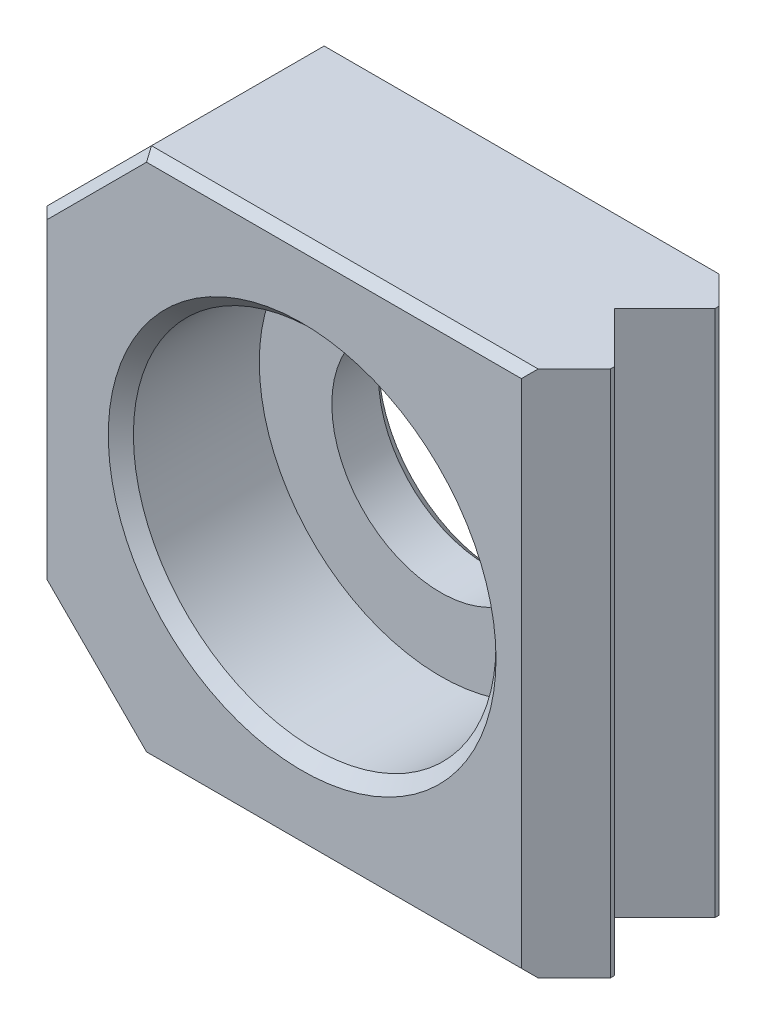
ISO-10303-21;
HEADER;
FILE_DESCRIPTION(('STEP AP214'),'2;1');
FILE_NAME('part.step','',(''),(''),'','','');
FILE_SCHEMA(('AUTOMOTIVE_DESIGN { 1 0 10303 214 1 1 1 1 }'));
ENDSEC;
DATA;
#1=APPLICATION_CONTEXT('core data for automotive mechanical design processes');
#2=APPLICATION_PROTOCOL_DEFINITION('international standard','automotive_design',2000,#1);
#3=PRODUCT_CONTEXT('',#1,'mechanical');
#4=PRODUCT('Part','Part','',(#3));
#5=PRODUCT_RELATED_PRODUCT_CATEGORY('part','',(#4));
#6=PRODUCT_DEFINITION_FORMATION('','',#4);
#7=PRODUCT_DEFINITION_CONTEXT('part definition',#1,'design');
#8=PRODUCT_DEFINITION('design','',#6,#7);
#9=PRODUCT_DEFINITION_SHAPE('','',#8);
#10=(LENGTH_UNIT() NAMED_UNIT(*) SI_UNIT(.MILLI.,.METRE.));
#11=(NAMED_UNIT(*) PLANE_ANGLE_UNIT() SI_UNIT($,.RADIAN.));
#12=(NAMED_UNIT(*) SI_UNIT($,.STERADIAN.) SOLID_ANGLE_UNIT());
#13=UNCERTAINTY_MEASURE_WITH_UNIT(LENGTH_MEASURE(1.E-05),#10,'distance_accuracy_value','');
#14=(GEOMETRIC_REPRESENTATION_CONTEXT(3) GLOBAL_UNCERTAINTY_ASSIGNED_CONTEXT((#13)) GLOBAL_UNIT_ASSIGNED_CONTEXT((#10,
#11,#12)) REPRESENTATION_CONTEXT('',''));
#15=CARTESIAN_POINT('',(0.,0.,0.));
#16=DIRECTION('',(0.,0.,1.));
#17=DIRECTION('',(1.,0.,0.));
#18=AXIS2_PLACEMENT_3D('',#15,#16,#17);
#19=CARTESIAN_POINT('',(8.,-8.,6.));
#20=DIRECTION('',(-1.,0.,0.));
#21=DIRECTION('',(0.,-1.,0.));
#22=AXIS2_PLACEMENT_3D('',#19,#20,#21);
#23=PLANE('',#22);
#24=DIRECTION('',(0.,-1.,0.));
#25=VECTOR('',#24,1.);
#26=CARTESIAN_POINT('',(8.,-8.,4.52399999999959));
#27=LINE('',#26,#25);
#28=CARTESIAN_POINT('',(8.,8.,4.52399999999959));
#29=VERTEX_POINT('',#28);
#30=CARTESIAN_POINT('',(8.,-8.,4.52399999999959));
#31=VERTEX_POINT('',#30);
#32=EDGE_CURVE('E147',#29,#31,#27,.T.);
#33=ORIENTED_EDGE('',*,*,#32,.F.);
#34=DIRECTION('',(0.,0.,-1.));
#35=VECTOR('',#34,1.);
#36=CARTESIAN_POINT('',(8.,8.,6.));
#37=LINE('',#36,#35);
#38=CARTESIAN_POINT('',(8.,8.,4.65099999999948));
#39=VERTEX_POINT('',#38);
#40=EDGE_CURVE('E189',#39,#29,#37,.T.);
#41=ORIENTED_EDGE('',*,*,#40,.F.);
#42=DIRECTION('',(0.,1.,0.));
#43=VECTOR('',#42,1.);
#44=CARTESIAN_POINT('',(8.,-8.,4.65099999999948));
#45=LINE('',#44,#43);
#46=CARTESIAN_POINT('',(8.,-8.,4.65099999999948));
#47=VERTEX_POINT('',#46);
#48=EDGE_CURVE('E173',#47,#39,#45,.T.);
#49=ORIENTED_EDGE('',*,*,#48,.F.);
#50=DIRECTION('',(0.,0.,-1.));
#51=VECTOR('',#50,1.);
#52=CARTESIAN_POINT('',(8.,-8.,6.));
#53=LINE('',#52,#51);
#54=EDGE_CURVE('E185',#47,#31,#53,.T.);
#55=ORIENTED_EDGE('',*,*,#54,.T.);
#56=EDGE_LOOP('',(#33,#41,#49,#55));
#57=FACE_BOUND('',#56,.T.);
#58=ADVANCED_FACE('F14',(#57),#23,.F.);
#59=CARTESIAN_POINT('',(8.,-8.,1.47600000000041));
#60=VERTEX_POINT('',#59);
#61=CARTESIAN_POINT('',(8.,-8.,1.34900000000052));
#62=VERTEX_POINT('',#61);
#63=EDGE_CURVE('E158',#60,#62,#53,.T.);
#64=ORIENTED_EDGE('',*,*,#63,.T.);
#65=DIRECTION('',(0.,1.,0.));
#66=VECTOR('',#65,1.);
#67=CARTESIAN_POINT('',(8.,-8.,1.34900000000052));
#68=LINE('',#67,#66);
#69=CARTESIAN_POINT('',(8.,8.,1.34900000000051));
#70=VERTEX_POINT('',#69);
#71=EDGE_CURVE('E141',#62,#70,#68,.T.);
#72=ORIENTED_EDGE('',*,*,#71,.T.);
#73=CARTESIAN_POINT('',(8.,8.,1.47600000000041));
#74=VERTEX_POINT('',#73);
#75=EDGE_CURVE('E186',#74,#70,#37,.T.);
#76=ORIENTED_EDGE('',*,*,#75,.F.);
#77=DIRECTION('',(0.,-1.,0.));
#78=VECTOR('',#77,1.);
#79=CARTESIAN_POINT('',(8.,-8.,1.47600000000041));
#80=LINE('',#79,#78);
#81=EDGE_CURVE('E176',#74,#60,#80,.T.);
#82=ORIENTED_EDGE('',*,*,#81,.T.);
#83=EDGE_LOOP('',(#64,#72,#76,#82));
#84=FACE_BOUND('',#83,.T.);
#85=ADVANCED_FACE('F336',(#84),#23,.F.);
#86=CARTESIAN_POINT('',(-8.,8.,6.));
#87=DIRECTION('',(0.,1.,0.));
#88=DIRECTION('',(-1.,0.,0.));
#89=AXIS2_PLACEMENT_3D('',#86,#87,#88);
#90=PLANE('',#89);
#91=DIRECTION('',(0.,0.,1.));
#92=VECTOR('',#91,1.);
#93=CARTESIAN_POINT('',(-4.825,8.,6.));
#94=LINE('',#93,#92);
#95=CARTESIAN_POINT('',(-4.825,8.,0.508));
#96=VERTEX_POINT('',#95);
#97=CARTESIAN_POINT('',(-4.825,8.,5.746));
#98=VERTEX_POINT('',#97);
#99=EDGE_CURVE('E196',#96,#98,#94,.T.);
#100=ORIENTED_EDGE('',*,*,#99,.T.);
#101=DIRECTION('',(1.,0.,0.));
#102=VECTOR('',#101,1.);
#103=CARTESIAN_POINT('',(6.651,8.,5.746));
#104=LINE('',#103,#102);
#105=CARTESIAN_POINT('',(6.90499999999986,8.,5.746));
#106=VERTEX_POINT('',#105);
#107=EDGE_CURVE('E9',#98,#106,#104,.T.);
#108=ORIENTED_EDGE('',*,*,#107,.T.);
#109=DIRECTION('',(-0.707106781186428,0.,0.707106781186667));
#110=VECTOR('',#109,1.);
#111=CARTESIAN_POINT('',(8.0635,8.,4.58749999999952));
#112=LINE('',#111,#110);
#113=EDGE_CURVE('E162',#39,#106,#112,.T.);
#114=ORIENTED_EDGE('',*,*,#113,.F.);
#115=ORIENTED_EDGE('',*,*,#40,.T.);
#116=DIRECTION('',(0.707106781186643,0.,0.707106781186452));
#117=VECTOR('',#116,1.);
#118=CARTESIAN_POINT('',(6.476,8.,3.));
#119=LINE('',#118,#117);
#120=CARTESIAN_POINT('',(6.476,8.,3.));
#121=VERTEX_POINT('',#120);
#122=EDGE_CURVE('E168',#121,#29,#119,.T.);
#123=ORIENTED_EDGE('',*,*,#122,.F.);
#124=DIRECTION('',(0.707106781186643,0.,-0.707106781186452));
#125=VECTOR('',#124,1.);
#126=CARTESIAN_POINT('',(6.476,8.,3.));
#127=LINE('',#126,#125);
#128=EDGE_CURVE('E138',#121,#74,#127,.T.);
#129=ORIENTED_EDGE('',*,*,#128,.T.);
#130=ORIENTED_EDGE('',*,*,#75,.T.);
#131=DIRECTION('',(-0.707106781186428,0.,-0.707106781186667));
#132=VECTOR('',#131,1.);
#133=CARTESIAN_POINT('',(8.0635,8.,1.41250000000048));
#134=LINE('',#133,#132);
#135=CARTESIAN_POINT('',(7.15899999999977,8.,0.508));
#136=VERTEX_POINT('',#135);
#137=EDGE_CURVE('E159',#70,#136,#134,.T.);
#138=ORIENTED_EDGE('',*,*,#137,.T.);
#139=DIRECTION('',(-1.,0.,0.));
#140=VECTOR('',#139,1.);
#141=CARTESIAN_POINT('',(-8.,8.,0.508));
#142=LINE('',#141,#140);
#143=EDGE_CURVE('E241',#136,#96,#142,.T.);
#144=ORIENTED_EDGE('',*,*,#143,.T.);
#145=EDGE_LOOP('',(#100,#108,#114,#115,#123,#129,#130,#138,#144));
#146=FACE_BOUND('',#145,.T.);
#147=ADVANCED_FACE('F341',(#146),#90,.T.);
#148=CARTESIAN_POINT('',(8.,-8.,6.));
#149=DIRECTION('',(0.,-1.,0.));
#150=DIRECTION('',(1.,0.,0.));
#151=AXIS2_PLACEMENT_3D('',#148,#149,#150);
#152=PLANE('',#151);
#153=DIRECTION('',(-0.707106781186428,0.,0.707106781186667));
#154=VECTOR('',#153,1.);
#155=CARTESIAN_POINT('',(8.0635,-8.,4.58749999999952));
#156=LINE('',#155,#154);
#157=CARTESIAN_POINT('',(6.90499999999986,-8.,5.746));
#158=VERTEX_POINT('',#157);
#159=EDGE_CURVE('E151',#47,#158,#156,.T.);
#160=ORIENTED_EDGE('',*,*,#159,.T.);
#161=DIRECTION('',(-1.,0.,0.));
#162=VECTOR('',#161,1.);
#163=CARTESIAN_POINT('',(-4.825,-8.,5.746));
#164=LINE('',#163,#162);
#165=CARTESIAN_POINT('',(-4.825,-8.,5.746));
#166=VERTEX_POINT('',#165);
#167=EDGE_CURVE('E243',#158,#166,#164,.T.);
#168=ORIENTED_EDGE('',*,*,#167,.T.);
#169=DIRECTION('',(0.,0.,-1.));
#170=VECTOR('',#169,1.);
#171=CARTESIAN_POINT('',(-4.825,-8.,0.));
#172=LINE('',#171,#170);
#173=CARTESIAN_POINT('',(-4.825,-8.,0.508));
#174=VERTEX_POINT('',#173);
#175=EDGE_CURVE('E190',#166,#174,#172,.T.);
#176=ORIENTED_EDGE('',*,*,#175,.T.);
#177=DIRECTION('',(1.,0.,0.));
#178=VECTOR('',#177,1.);
#179=CARTESIAN_POINT('',(8.,-8.,0.508));
#180=LINE('',#179,#178);
#181=CARTESIAN_POINT('',(7.15899999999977,-8.,0.508));
#182=VERTEX_POINT('',#181);
#183=EDGE_CURVE('E227',#174,#182,#180,.T.);
#184=ORIENTED_EDGE('',*,*,#183,.T.);
#185=DIRECTION('',(-0.707106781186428,0.,-0.707106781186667));
#186=VECTOR('',#185,1.);
#187=CARTESIAN_POINT('',(8.0635,-8.,1.41250000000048));
#188=LINE('',#187,#186);
#189=EDGE_CURVE('E302',#62,#182,#188,.T.);
#190=ORIENTED_EDGE('',*,*,#189,.F.);
#191=ORIENTED_EDGE('',*,*,#63,.F.);
#192=DIRECTION('',(0.707106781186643,0.,-0.707106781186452));
#193=VECTOR('',#192,1.);
#194=CARTESIAN_POINT('',(6.476,-8.,3.));
#195=LINE('',#194,#193);
#196=CARTESIAN_POINT('',(6.476,-8.,3.));
#197=VERTEX_POINT('',#196);
#198=EDGE_CURVE('E135',#197,#60,#195,.T.);
#199=ORIENTED_EDGE('',*,*,#198,.F.);
#200=DIRECTION('',(0.707106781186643,0.,0.707106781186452));
#201=VECTOR('',#200,1.);
#202=CARTESIAN_POINT('',(6.476,-8.,3.));
#203=LINE('',#202,#201);
#204=EDGE_CURVE('E144',#197,#31,#203,.T.);
#205=ORIENTED_EDGE('',*,*,#204,.T.);
#206=ORIENTED_EDGE('',*,*,#54,.F.);
#207=EDGE_LOOP('',(#160,#168,#176,#184,#190,#191,#199,#205,#206));
#208=FACE_BOUND('',#207,.T.);
#209=ADVANCED_FACE('F155',(#208),#152,.T.);
#210=CARTESIAN_POINT('',(8.,8.,6.));
#211=DIRECTION('',(0.,0.,-1.));
#212=DIRECTION('',(1.,0.,0.));
#213=AXIS2_PLACEMENT_3D('',#210,#211,#212);
#214=PLANE('',#213);
#215=CARTESIAN_POINT('',(0.,0.,6.));
#216=DIRECTION('',(0.,0.,-1.));
#217=DIRECTION('',(1.,0.,0.));
#218=AXIS2_PLACEMENT_3D('',#215,#216,#217);
#219=CIRCLE('',#218,5.881);
#220=CARTESIAN_POINT('',(5.881,0.,6.));
#221=VERTEX_POINT('',#220);
#222=EDGE_CURVE('E207',#221,#221,#219,.T.);
#223=ORIENTED_EDGE('',*,*,#222,.T.);
#224=EDGE_LOOP('',(#223));
#225=FACE_BOUND('',#224,.T.);
#226=DIRECTION('',(0.707106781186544,-0.707106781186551,0.));
#227=VECTOR('',#226,1.);
#228=CARTESIAN_POINT('',(-4.64539487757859,-7.82039487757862,6.));
#229=LINE('',#228,#227);
#230=CARTESIAN_POINT('',(-7.746,-4.71978975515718,6.));
#231=VERTEX_POINT('',#230);
#232=CARTESIAN_POINT('',(-4.71978975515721,-7.746,6.));
#233=VERTEX_POINT('',#232);
#234=EDGE_CURVE('E252',#231,#233,#229,.T.);
#235=ORIENTED_EDGE('',*,*,#234,.T.);
#236=DIRECTION('',(1.,0.,0.));
#237=VECTOR('',#236,1.);
#238=CARTESIAN_POINT('',(6.651,-7.746,6.));
#239=LINE('',#238,#237);
#240=CARTESIAN_POINT('',(6.651,-7.746,6.));
#241=VERTEX_POINT('',#240);
#242=EDGE_CURVE('E254',#233,#241,#239,.T.);
#243=ORIENTED_EDGE('',*,*,#242,.T.);
#244=DIRECTION('',(0.,-1.,0.));
#245=VECTOR('',#244,1.);
#246=CARTESIAN_POINT('',(6.651,8.,6.));
#247=LINE('',#246,#245);
#248=CARTESIAN_POINT('',(6.651,7.746,6.));
#249=VERTEX_POINT('',#248);
#250=EDGE_CURVE('E201',#249,#241,#247,.T.);
#251=ORIENTED_EDGE('',*,*,#250,.F.);
#252=DIRECTION('',(-1.,0.,0.));
#253=VECTOR('',#252,1.);
#254=CARTESIAN_POINT('',(-4.825,7.746,6.));
#255=LINE('',#254,#253);
#256=CARTESIAN_POINT('',(-4.71978975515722,7.746,6.));
#257=VERTEX_POINT('',#256);
#258=EDGE_CURVE('E246',#249,#257,#255,.T.);
#259=ORIENTED_EDGE('',*,*,#258,.T.);
#260=DIRECTION('',(-0.707106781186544,-0.707106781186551,0.));
#261=VECTOR('',#260,1.);
#262=CARTESIAN_POINT('',(-7.82039487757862,4.64539487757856,6.));
#263=LINE('',#262,#261);
#264=CARTESIAN_POINT('',(-7.746,4.71978975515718,6.));
#265=VERTEX_POINT('',#264);
#266=EDGE_CURVE('E248',#257,#265,#263,.T.);
#267=ORIENTED_EDGE('',*,*,#266,.T.);
#268=DIRECTION('',(0.,-1.,0.));
#269=VECTOR('',#268,1.);
#270=CARTESIAN_POINT('',(-7.746,8.,6.));
#271=LINE('',#270,#269);
#272=EDGE_CURVE('E250',#265,#231,#271,.T.);
#273=ORIENTED_EDGE('',*,*,#272,.T.);
#274=EDGE_LOOP('',(#235,#243,#251,#259,#267,#273));
#275=FACE_BOUND('',#274,.T.);
#276=ADVANCED_FACE('F313',(#225,#275),#214,.F.);
#277=CARTESIAN_POINT('',(-8.,8.,6.));
#278=DIRECTION('',(1.,0.,0.));
#279=DIRECTION('',(0.,1.,0.));
#280=AXIS2_PLACEMENT_3D('',#277,#278,#279);
#281=PLANE('',#280);
#282=DIRECTION('',(0.,0.,1.));
#283=VECTOR('',#282,1.);
#284=CARTESIAN_POINT('',(-8.,-4.825,6.));
#285=LINE('',#284,#283);
#286=CARTESIAN_POINT('',(-8.,-4.825,0.508));
#287=VERTEX_POINT('',#286);
#288=CARTESIAN_POINT('',(-8.,-4.825,5.746));
#289=VERTEX_POINT('',#288);
#290=EDGE_CURVE('E194',#287,#289,#285,.T.);
#291=ORIENTED_EDGE('',*,*,#290,.T.);
#292=DIRECTION('',(0.,1.,0.));
#293=VECTOR('',#292,1.);
#294=CARTESIAN_POINT('',(-8.,8.,5.746));
#295=LINE('',#294,#293);
#296=CARTESIAN_POINT('',(-8.,4.82499999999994,5.746));
#297=VERTEX_POINT('',#296);
#298=EDGE_CURVE('E35',#289,#297,#295,.T.);
#299=ORIENTED_EDGE('',*,*,#298,.T.);
#300=DIRECTION('',(0.,0.,-1.));
#301=VECTOR('',#300,1.);
#302=CARTESIAN_POINT('',(-8.,4.82499999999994,0.));
#303=LINE('',#302,#301);
#304=CARTESIAN_POINT('',(-8.,4.82499999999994,0.508));
#305=VERTEX_POINT('',#304);
#306=EDGE_CURVE('E192',#297,#305,#303,.T.);
#307=ORIENTED_EDGE('',*,*,#306,.T.);
#308=DIRECTION('',(0.,-1.,0.));
#309=VECTOR('',#308,1.);
#310=CARTESIAN_POINT('',(-8.,-4.825,0.508));
#311=LINE('',#310,#309);
#312=EDGE_CURVE('E236',#305,#287,#311,.T.);
#313=ORIENTED_EDGE('',*,*,#312,.T.);
#314=EDGE_LOOP('',(#291,#299,#307,#313));
#315=FACE_BOUND('',#314,.T.);
#316=ADVANCED_FACE('F271',(#315),#281,.F.);
#317=CARTESIAN_POINT('',(8.,8.,0.));
#318=DIRECTION('',(0.,0.,-1.));
#319=DIRECTION('',(1.,0.,0.));
#320=AXIS2_PLACEMENT_3D('',#317,#318,#319);
#321=PLANE('',#320);
#322=CARTESIAN_POINT('',(0.,0.,0.));
#323=DIRECTION('',(0.,0.,-1.));
#324=DIRECTION('',(1.,0.,0.));
#325=AXIS2_PLACEMENT_3D('',#322,#323,#324);
#326=CIRCLE('',#325,3.681);
#327=CARTESIAN_POINT('',(3.681,0.,0.));
#328=VERTEX_POINT('',#327);
#329=EDGE_CURVE('E210',#328,#328,#326,.F.);
#330=ORIENTED_EDGE('',*,*,#329,.T.);
#331=EDGE_LOOP('',(#330));
#332=FACE_BOUND('',#331,.T.);
#333=DIRECTION('',(0.,1.,0.));
#334=VECTOR('',#333,1.);
#335=CARTESIAN_POINT('',(6.651,8.,0.));
#336=LINE('',#335,#334);
#337=CARTESIAN_POINT('',(6.651,-7.492,0.));
#338=VERTEX_POINT('',#337);
#339=CARTESIAN_POINT('',(6.651,7.492,0.));
#340=VERTEX_POINT('',#339);
#341=EDGE_CURVE('E198',#338,#340,#336,.T.);
#342=ORIENTED_EDGE('',*,*,#341,.F.);
#343=DIRECTION('',(-1.,0.,0.));
#344=VECTOR('',#343,1.);
#345=CARTESIAN_POINT('',(8.,-7.492,0.));
#346=LINE('',#345,#344);
#347=CARTESIAN_POINT('',(-4.61457951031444,-7.492,0.));
#348=VERTEX_POINT('',#347);
#349=EDGE_CURVE('E224',#338,#348,#346,.T.);
#350=ORIENTED_EDGE('',*,*,#349,.T.);
#351=DIRECTION('',(-0.707106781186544,0.707106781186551,0.));
#352=VECTOR('',#351,1.);
#353=CARTESIAN_POINT('',(-6.05328975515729,-6.05328975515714,0.));
#354=LINE('',#353,#352);
#355=CARTESIAN_POINT('',(-7.492,-4.61457951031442,0.));
#356=VERTEX_POINT('',#355);
#357=EDGE_CURVE('E222',#348,#356,#354,.T.);
#358=ORIENTED_EDGE('',*,*,#357,.T.);
#359=DIRECTION('',(0.,1.,0.));
#360=VECTOR('',#359,1.);
#361=CARTESIAN_POINT('',(-7.492,4.82499999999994,0.));
#362=LINE('',#361,#360);
#363=CARTESIAN_POINT('',(-7.492,4.61457951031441,0.));
#364=VERTEX_POINT('',#363);
#365=EDGE_CURVE('E220',#356,#364,#362,.T.);
#366=ORIENTED_EDGE('',*,*,#365,.T.);
#367=DIRECTION('',(0.707106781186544,0.707106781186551,0.));
#368=VECTOR('',#367,1.);
#369=CARTESIAN_POINT('',(1.94671024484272,14.0532897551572,0.));
#370=LINE('',#369,#368);
#371=CARTESIAN_POINT('',(-4.61457951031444,7.492,0.));
#372=VERTEX_POINT('',#371);
#373=EDGE_CURVE('E218',#364,#372,#370,.T.);
#374=ORIENTED_EDGE('',*,*,#373,.T.);
#375=DIRECTION('',(1.,0.,0.));
#376=VECTOR('',#375,1.);
#377=CARTESIAN_POINT('',(8.,7.492,0.));
#378=LINE('',#377,#376);
#379=EDGE_CURVE('E216',#372,#340,#378,.T.);
#380=ORIENTED_EDGE('',*,*,#379,.T.);
#381=EDGE_LOOP('',(#342,#350,#358,#366,#374,#380));
#382=FACE_BOUND('',#381,.T.);
#383=ADVANCED_FACE('F375',(#332,#382),#321,.T.);
#384=CARTESIAN_POINT('',(-4.825,-8.,6.));
#385=DIRECTION('',(-0.707106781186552,-0.707106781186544,0.));
#386=DIRECTION('',(0.707106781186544,-0.707106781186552,0.));
#387=AXIS2_PLACEMENT_3D('',#384,#385,#386);
#388=PLANE('',#387);
#389=ORIENTED_EDGE('',*,*,#175,.F.);
#390=DIRECTION('',(-0.707106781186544,0.707106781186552,0.));
#391=VECTOR('',#390,1.);
#392=CARTESIAN_POINT('',(-8.,-4.82499999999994,5.746));
#393=LINE('',#392,#391);
#394=EDGE_CURVE('E260',#166,#289,#393,.T.);
#395=ORIENTED_EDGE('',*,*,#394,.T.);
#396=ORIENTED_EDGE('',*,*,#290,.F.);
#397=DIRECTION('',(0.707106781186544,-0.707106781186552,0.));
#398=VECTOR('',#397,1.);
#399=CARTESIAN_POINT('',(-4.825,-8.,0.508));
#400=LINE('',#399,#398);
#401=EDGE_CURVE('E233',#287,#174,#400,.T.);
#402=ORIENTED_EDGE('',*,*,#401,.T.);
#403=EDGE_LOOP('',(#389,#395,#396,#402));
#404=FACE_BOUND('',#403,.T.);
#405=ADVANCED_FACE('F266',(#404),#388,.T.);
#406=CARTESIAN_POINT('',(-8.,4.82499999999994,6.));
#407=DIRECTION('',(-0.707106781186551,0.707106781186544,0.));
#408=DIRECTION('',(-0.707106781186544,-0.707106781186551,0.));
#409=AXIS2_PLACEMENT_3D('',#406,#407,#408);
#410=PLANE('',#409);
#411=ORIENTED_EDGE('',*,*,#306,.F.);
#412=DIRECTION('',(0.707106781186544,0.707106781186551,0.));
#413=VECTOR('',#412,1.);
#414=CARTESIAN_POINT('',(-4.825,8.,5.746));
#415=LINE('',#414,#413);
#416=EDGE_CURVE('E21',#297,#98,#415,.T.);
#417=ORIENTED_EDGE('',*,*,#416,.T.);
#418=ORIENTED_EDGE('',*,*,#99,.F.);
#419=DIRECTION('',(-0.707106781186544,-0.707106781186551,0.));
#420=VECTOR('',#419,1.);
#421=CARTESIAN_POINT('',(-8.,4.82499999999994,0.508));
#422=LINE('',#421,#420);
#423=EDGE_CURVE('E238',#96,#305,#422,.T.);
#424=ORIENTED_EDGE('',*,*,#423,.T.);
#425=EDGE_LOOP('',(#411,#417,#418,#424));
#426=FACE_BOUND('',#425,.T.);
#427=ADVANCED_FACE('F348',(#426),#410,.T.);
#428=CARTESIAN_POINT('',(0.,0.,1.8));
#429=DIRECTION('',(0.,0.,1.));
#430=DIRECTION('',(-1.,0.,0.));
#431=AXIS2_PLACEMENT_3D('',#428,#429,#430);
#432=CYLINDRICAL_SURFACE('',#431,5.5);
#433=CARTESIAN_POINT('',(0.,0.,5.619));
#434=DIRECTION('',(0.,0.,-1.));
#435=DIRECTION('',(1.,0.,0.));
#436=AXIS2_PLACEMENT_3D('',#433,#434,#435);
#437=CIRCLE('',#436,5.5);
#438=CARTESIAN_POINT('',(5.5,0.,5.619));
#439=VERTEX_POINT('',#438);
#440=EDGE_CURVE('E204',#439,#439,#437,.F.);
#441=ORIENTED_EDGE('',*,*,#440,.T.);
#442=EDGE_LOOP('',(#441));
#443=FACE_BOUND('',#442,.T.);
#444=CARTESIAN_POINT('',(0.,0.,1.8));
#445=DIRECTION('',(0.,0.,1.));
#446=DIRECTION('',(-1.,0.,0.));
#447=AXIS2_PLACEMENT_3D('',#444,#445,#446);
#448=CIRCLE('',#447,5.5);
#449=CARTESIAN_POINT('',(-5.5,0.,1.8));
#450=VERTEX_POINT('',#449);
#451=EDGE_CURVE('E181',#450,#450,#448,.T.);
#452=ORIENTED_EDGE('',*,*,#451,.F.);
#453=EDGE_LOOP('',(#452));
#454=FACE_BOUND('',#453,.T.);
#455=ADVANCED_FACE('F437',(#443,#454),#432,.F.);
#456=CARTESIAN_POINT('',(0.,0.,1.8));
#457=DIRECTION('',(0.,0.,1.));
#458=DIRECTION('',(-1.,0.,0.));
#459=AXIS2_PLACEMENT_3D('',#456,#457,#458);
#460=PLANE('',#459);
#461=CARTESIAN_POINT('',(0.,0.,1.8));
#462=DIRECTION('',(0.,0.,1.));
#463=DIRECTION('',(-1.,0.,0.));
#464=AXIS2_PLACEMENT_3D('',#461,#462,#463);
#465=CIRCLE('',#464,3.3);
#466=CARTESIAN_POINT('',(-3.3,0.,1.8));
#467=VERTEX_POINT('',#466);
#468=EDGE_CURVE('E178',#467,#467,#465,.T.);
#469=ORIENTED_EDGE('',*,*,#468,.F.);
#470=EDGE_LOOP('',(#469));
#471=FACE_BOUND('',#470,.T.);
#472=ORIENTED_EDGE('',*,*,#451,.T.);
#473=EDGE_LOOP('',(#472));
#474=FACE_BOUND('',#473,.T.);
#475=ADVANCED_FACE('F445',(#471,#474),#460,.T.);
#476=CARTESIAN_POINT('',(0.,0.,0.));
#477=DIRECTION('',(0.,0.,1.));
#478=DIRECTION('',(-1.,0.,0.));
#479=AXIS2_PLACEMENT_3D('',#476,#477,#478);
#480=CYLINDRICAL_SURFACE('',#479,3.3);
#481=CARTESIAN_POINT('',(0.,0.,0.381));
#482=DIRECTION('',(0.,0.,-1.));
#483=DIRECTION('',(1.,0.,0.));
#484=AXIS2_PLACEMENT_3D('',#481,#482,#483);
#485=CIRCLE('',#484,3.3);
#486=CARTESIAN_POINT('',(3.3,0.,0.381));
#487=VERTEX_POINT('',#486);
#488=EDGE_CURVE('E213',#487,#487,#485,.T.);
#489=ORIENTED_EDGE('',*,*,#488,.T.);
#490=EDGE_LOOP('',(#489));
#491=FACE_BOUND('',#490,.T.);
#492=ORIENTED_EDGE('',*,*,#468,.T.);
#493=EDGE_LOOP('',(#492));
#494=FACE_BOUND('',#493,.T.);
#495=ADVANCED_FACE('F455',(#491,#494),#480,.F.);
#496=CARTESIAN_POINT('',(8.0635,8.,1.41250000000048));
#497=DIRECTION('',(-0.707106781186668,0.,0.707106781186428));
#498=DIRECTION('',(-0.707106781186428,0.,-0.707106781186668));
#499=AXIS2_PLACEMENT_3D('',#496,#497,#498);
#500=PLANE('',#499);
#501=ORIENTED_EDGE('',*,*,#189,.T.);
#502=DIRECTION('',(0.577350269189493,-0.577350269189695,0.577350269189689));
#503=VECTOR('',#502,1.);
#504=CARTESIAN_POINT('',(7.10066666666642,-7.94166666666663,0.449666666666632));
#505=LINE('',#504,#503);
#506=EDGE_CURVE('E231',#182,#338,#505,.F.);
#507=ORIENTED_EDGE('',*,*,#506,.T.);
#508=ORIENTED_EDGE('',*,*,#341,.T.);
#509=DIRECTION('',(-0.577350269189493,-0.577350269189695,-0.577350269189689));
#510=VECTOR('',#509,1.);
#511=CARTESIAN_POINT('',(7.10066666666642,7.94166666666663,0.449666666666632));
#512=LINE('',#511,#510);
#513=EDGE_CURVE('E229',#340,#136,#512,.F.);
#514=ORIENTED_EDGE('',*,*,#513,.T.);
#515=ORIENTED_EDGE('',*,*,#137,.F.);
#516=ORIENTED_EDGE('',*,*,#71,.F.);
#517=EDGE_LOOP('',(#501,#507,#508,#514,#515,#516));
#518=FACE_BOUND('',#517,.T.);
#519=ADVANCED_FACE('F371',(#518),#500,.F.);
#520=CARTESIAN_POINT('',(8.0635,8.,4.58749999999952));
#521=DIRECTION('',(0.707106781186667,0.,0.707106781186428));
#522=DIRECTION('',(-0.707106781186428,0.,0.707106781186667));
#523=AXIS2_PLACEMENT_3D('',#520,#521,#522);
#524=PLANE('',#523);
#525=ORIENTED_EDGE('',*,*,#250,.T.);
#526=DIRECTION('',(0.577350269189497,-0.577350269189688,-0.577350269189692));
#527=VECTOR('',#526,1.);
#528=CARTESIAN_POINT('',(2.34400000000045,-3.43899999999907,10.3070000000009));
#529=LINE('',#528,#527);
#530=EDGE_CURVE('E258',#241,#158,#529,.T.);
#531=ORIENTED_EDGE('',*,*,#530,.T.);
#532=ORIENTED_EDGE('',*,*,#159,.F.);
#533=ORIENTED_EDGE('',*,*,#48,.T.);
#534=ORIENTED_EDGE('',*,*,#113,.T.);
#535=DIRECTION('',(-0.577350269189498,-0.577350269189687,0.577350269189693));
#536=VECTOR('',#535,1.);
#537=CARTESIAN_POINT('',(7.67733333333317,8.77233333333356,4.97366666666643));
#538=LINE('',#537,#536);
#539=EDGE_CURVE('E256',#106,#249,#538,.T.);
#540=ORIENTED_EDGE('',*,*,#539,.T.);
#541=EDGE_LOOP('',(#525,#531,#532,#533,#534,#540));
#542=FACE_BOUND('',#541,.T.);
#543=ADVANCED_FACE('F315',(#542),#524,.T.);
#544=CARTESIAN_POINT('',(6.476,8.,3.));
#545=DIRECTION('',(-0.707106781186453,0.,-0.707106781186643));
#546=DIRECTION('',(0.707106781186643,0.,-0.707106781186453));
#547=AXIS2_PLACEMENT_3D('',#544,#545,#546);
#548=PLANE('',#547);
#549=ORIENTED_EDGE('',*,*,#128,.F.);
#550=DIRECTION('',(0.,-1.,0.));
#551=VECTOR('',#550,1.);
#552=CARTESIAN_POINT('',(6.476,8.,3.));
#553=LINE('',#552,#551);
#554=EDGE_CURVE('E131',#121,#197,#553,.T.);
#555=ORIENTED_EDGE('',*,*,#554,.T.);
#556=ORIENTED_EDGE('',*,*,#198,.T.);
#557=ORIENTED_EDGE('',*,*,#81,.F.);
#558=EDGE_LOOP('',(#549,#555,#556,#557));
#559=FACE_BOUND('',#558,.T.);
#560=ADVANCED_FACE('F133',(#559),#548,.F.);
#561=CARTESIAN_POINT('',(6.476,8.,3.));
#562=DIRECTION('',(0.707106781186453,0.,-0.707106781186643));
#563=DIRECTION('',(0.707106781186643,0.,0.707106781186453));
#564=AXIS2_PLACEMENT_3D('',#561,#562,#563);
#565=PLANE('',#564);
#566=ORIENTED_EDGE('',*,*,#32,.T.);
#567=ORIENTED_EDGE('',*,*,#204,.F.);
#568=ORIENTED_EDGE('',*,*,#554,.F.);
#569=ORIENTED_EDGE('',*,*,#122,.T.);
#570=EDGE_LOOP('',(#566,#567,#568,#569));
#571=FACE_BOUND('',#570,.T.);
#572=ADVANCED_FACE('F145',(#571),#565,.T.);
#573=CARTESIAN_POINT('',(0.,0.,5.619));
#574=DIRECTION('',(0.,0.,1.));
#575=DIRECTION('',(-1.,0.,0.));
#576=AXIS2_PLACEMENT_3D('',#573,#574,#575);
#577=CONICAL_SURFACE('',#576,5.5,0.785398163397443);
#578=ORIENTED_EDGE('',*,*,#222,.F.);
#579=EDGE_LOOP('',(#578));
#580=FACE_BOUND('',#579,.T.);
#581=ORIENTED_EDGE('',*,*,#440,.F.);
#582=EDGE_LOOP('',(#581));
#583=FACE_BOUND('',#582,.T.);
#584=ADVANCED_FACE('F498',(#580,#583),#577,.F.);
#585=CARTESIAN_POINT('',(0.,0.,0.));
#586=DIRECTION('',(0.,0.,-1.));
#587=DIRECTION('',(1.,0.,0.));
#588=AXIS2_PLACEMENT_3D('',#585,#586,#587);
#589=CONICAL_SURFACE('',#588,3.681,0.785398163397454);
#590=ORIENTED_EDGE('',*,*,#488,.F.);
#591=EDGE_LOOP('',(#590));
#592=FACE_BOUND('',#591,.T.);
#593=ORIENTED_EDGE('',*,*,#329,.F.);
#594=EDGE_LOOP('',(#593));
#595=FACE_BOUND('',#594,.T.);
#596=ADVANCED_FACE('F507',(#592,#595),#589,.F.);
#597=CARTESIAN_POINT('',(8.,7.492,0.));
#598=DIRECTION('',(0.,-0.707106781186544,0.707106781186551));
#599=DIRECTION('',(0.,-0.707106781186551,-0.707106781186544));
#600=AXIS2_PLACEMENT_3D('',#597,#598,#599);
#601=PLANE('',#600);
#602=ORIENTED_EDGE('',*,*,#513,.F.);
#603=ORIENTED_EDGE('',*,*,#379,.F.);
#604=DIRECTION('',(-0.281084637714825,0.67859834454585,0.678598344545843));
#605=VECTOR('',#604,1.);
#606=CARTESIAN_POINT('',(-3.61791957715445,5.0858500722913,-2.40614992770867));
#607=LINE('',#606,#605);
#608=EDGE_CURVE('E299',#96,#372,#607,.F.);
#609=ORIENTED_EDGE('',*,*,#608,.F.);
#610=ORIENTED_EDGE('',*,*,#143,.F.);
#611=EDGE_LOOP('',(#602,#603,#609,#610));
#612=FACE_BOUND('',#611,.T.);
#613=ADVANCED_FACE('F354',(#612),#601,.F.);
#614=CARTESIAN_POINT('',(1.94671024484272,14.0532897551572,0.));
#615=DIRECTION('',(0.5,-0.5,0.707106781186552));
#616=DIRECTION('',(-0.816496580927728,0.,0.577350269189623));
#617=AXIS2_PLACEMENT_3D('',#614,#615,#616);
#618=PLANE('',#617);
#619=ORIENTED_EDGE('',*,*,#608,.T.);
#620=ORIENTED_EDGE('',*,*,#373,.F.);
#621=DIRECTION('',(0.67859834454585,-0.281084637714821,-0.678598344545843));
#622=VECTOR('',#621,1.);
#623=CARTESIAN_POINT('',(-4.94588768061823,3.55994525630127,-2.54611231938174));
#624=LINE('',#623,#622);
#625=EDGE_CURVE('E296',#305,#364,#624,.T.);
#626=ORIENTED_EDGE('',*,*,#625,.F.);
#627=ORIENTED_EDGE('',*,*,#423,.F.);
#628=EDGE_LOOP('',(#619,#620,#626,#627));
#629=FACE_BOUND('',#628,.T.);
#630=ADVANCED_FACE('F357',(#629),#618,.F.);
#631=CARTESIAN_POINT('',(-8.,8.,0.508));
#632=DIRECTION('',(-0.707106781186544,0.,-0.707106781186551));
#633=DIRECTION('',(0.707106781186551,0.,-0.707106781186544));
#634=AXIS2_PLACEMENT_3D('',#631,#632,#633);
#635=PLANE('',#634);
#636=ORIENTED_EDGE('',*,*,#625,.T.);
#637=ORIENTED_EDGE('',*,*,#365,.F.);
#638=DIRECTION('',(0.678598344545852,0.281084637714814,-0.678598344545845));
#639=VECTOR('',#638,1.);
#640=CARTESIAN_POINT('',(-5.55371371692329,-3.81171504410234,-1.93828628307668));
#641=LINE('',#640,#639);
#642=EDGE_CURVE('E293',#287,#356,#641,.T.);
#643=ORIENTED_EDGE('',*,*,#642,.F.);
#644=ORIENTED_EDGE('',*,*,#312,.F.);
#645=EDGE_LOOP('',(#636,#637,#643,#644));
#646=FACE_BOUND('',#645,.T.);
#647=ADVANCED_FACE('F360',(#646),#635,.T.);
#648=CARTESIAN_POINT('',(-6.05328975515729,-6.05328975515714,0.));
#649=DIRECTION('',(0.5,0.5,0.707106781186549));
#650=DIRECTION('',(-0.816496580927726,0.,0.577350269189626));
#651=AXIS2_PLACEMENT_3D('',#648,#649,#650);
#652=PLANE('',#651);
#653=ORIENTED_EDGE('',*,*,#642,.T.);
#654=ORIENTED_EDGE('',*,*,#357,.F.);
#655=DIRECTION('',(-0.281084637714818,-0.678598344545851,0.678598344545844));
#656=VECTOR('',#655,1.);
#657=CARTESIAN_POINT('',(-4.45382522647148,-7.10390482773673,-0.388095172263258));
#658=LINE('',#657,#656);
#659=EDGE_CURVE('E291',#174,#348,#658,.F.);
#660=ORIENTED_EDGE('',*,*,#659,.F.);
#661=ORIENTED_EDGE('',*,*,#401,.F.);
#662=EDGE_LOOP('',(#653,#654,#660,#661));
#663=FACE_BOUND('',#662,.T.);
#664=ADVANCED_FACE('F365',(#663),#652,.F.);
#665=CARTESIAN_POINT('',(8.,-7.492,0.));
#666=DIRECTION('',(0.,0.707106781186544,0.707106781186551));
#667=DIRECTION('',(0.,-0.707106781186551,0.707106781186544));
#668=AXIS2_PLACEMENT_3D('',#665,#666,#667);
#669=PLANE('',#668);
#670=ORIENTED_EDGE('',*,*,#506,.F.);
#671=ORIENTED_EDGE('',*,*,#183,.F.);
#672=ORIENTED_EDGE('',*,*,#659,.T.);
#673=ORIENTED_EDGE('',*,*,#349,.F.);
#674=EDGE_LOOP('',(#670,#671,#672,#673));
#675=FACE_BOUND('',#674,.T.);
#676=ADVANCED_FACE('F333',(#675),#669,.F.);
#677=CARTESIAN_POINT('',(-8.,8.,5.746));
#678=DIRECTION('',(0.,0.707106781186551,0.707106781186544));
#679=DIRECTION('',(0.,-0.707106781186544,0.707106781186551));
#680=AXIS2_PLACEMENT_3D('',#677,#678,#679);
#681=PLANE('',#680);
#682=ORIENTED_EDGE('',*,*,#539,.F.);
#683=ORIENTED_EDGE('',*,*,#107,.F.);
#684=DIRECTION('',(0.281084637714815,-0.678598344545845,0.678598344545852));
#685=VECTOR('',#684,1.);
#686=CARTESIAN_POINT('',(-5.07585222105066,8.60561083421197,5.14038916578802));
#687=LINE('',#686,#685);
#688=EDGE_CURVE('E285',#257,#98,#687,.F.);
#689=ORIENTED_EDGE('',*,*,#688,.F.);
#690=ORIENTED_EDGE('',*,*,#258,.F.);
#691=EDGE_LOOP('',(#682,#683,#689,#690));
#692=FACE_BOUND('',#691,.T.);
#693=ADVANCED_FACE('F320',(#692),#681,.T.);
#694=CARTESIAN_POINT('',(1.76710512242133,14.2328948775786,6.));
#695=DIRECTION('',(-0.500000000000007,0.5,0.707106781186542));
#696=DIRECTION('',(-0.81649658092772,0.,-0.577350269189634));
#697=AXIS2_PLACEMENT_3D('',#694,#695,#696);
#698=PLANE('',#697);
#699=ORIENTED_EDGE('',*,*,#688,.T.);
#700=ORIENTED_EDGE('',*,*,#416,.F.);
#701=DIRECTION('',(-0.678598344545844,0.281084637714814,-0.678598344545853));
#702=VECTOR('',#701,1.);
#703=CARTESIAN_POINT('',(-5.1798195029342,3.65684298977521,8.56618049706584));
#704=LINE('',#703,#702);
#705=EDGE_CURVE('E281',#265,#297,#704,.T.);
#706=ORIENTED_EDGE('',*,*,#705,.F.);
#707=ORIENTED_EDGE('',*,*,#266,.F.);
#708=EDGE_LOOP('',(#699,#700,#706,#707));
#709=FACE_BOUND('',#708,.T.);
#710=ADVANCED_FACE('F324',(#709),#698,.T.);
#711=CARTESIAN_POINT('',(-7.746,8.,6.));
#712=DIRECTION('',(0.707106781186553,0.,-0.707106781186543));
#713=DIRECTION('',(0.707106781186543,0.,0.707106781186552));
#714=AXIS2_PLACEMENT_3D('',#711,#712,#713);
#715=PLANE('',#714);
#716=ORIENTED_EDGE('',*,*,#705,.T.);
#717=ORIENTED_EDGE('',*,*,#298,.F.);
#718=DIRECTION('',(-0.678598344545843,-0.28108463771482,-0.678598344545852));
#719=VECTOR('',#718,1.);
#720=CARTESIAN_POINT('',(-5.31978189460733,-3.71481731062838,8.4262181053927));
#721=LINE('',#720,#719);
#722=EDGE_CURVE('E278',#231,#289,#721,.T.);
#723=ORIENTED_EDGE('',*,*,#722,.F.);
#724=ORIENTED_EDGE('',*,*,#272,.F.);
#725=EDGE_LOOP('',(#716,#717,#723,#724));
#726=FACE_BOUND('',#725,.T.);
#727=ADVANCED_FACE('F276',(#726),#715,.F.);
#728=CARTESIAN_POINT('',(-6.23289487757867,-6.23289487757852,6.));
#729=DIRECTION('',(-0.5,-0.5,0.707106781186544));
#730=DIRECTION('',(-0.816496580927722,0.,-0.577350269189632));
#731=AXIS2_PLACEMENT_3D('',#728,#729,#730);
#732=PLANE('',#731);
#733=ORIENTED_EDGE('',*,*,#722,.T.);
#734=ORIENTED_EDGE('',*,*,#394,.F.);
#735=DIRECTION('',(0.281084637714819,0.678598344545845,0.67859834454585));
#736=VECTOR('',#735,1.);
#737=CARTESIAN_POINT('',(-4.5507229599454,-7.33783665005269,6.40816334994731));
#738=LINE('',#737,#736);
#739=EDGE_CURVE('E283',#233,#166,#738,.F.);
#740=ORIENTED_EDGE('',*,*,#739,.F.);
#741=ORIENTED_EDGE('',*,*,#234,.F.);
#742=EDGE_LOOP('',(#733,#734,#740,#741));
#743=FACE_BOUND('',#742,.T.);
#744=ADVANCED_FACE('F282',(#743),#732,.T.);
#745=CARTESIAN_POINT('',(8.,-8.,5.746));
#746=DIRECTION('',(0.,-0.70710678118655,0.707106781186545));
#747=DIRECTION('',(0.,-0.707106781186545,-0.70710678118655));
#748=AXIS2_PLACEMENT_3D('',#745,#746,#747);
#749=PLANE('',#748);
#750=ORIENTED_EDGE('',*,*,#530,.F.);
#751=ORIENTED_EDGE('',*,*,#242,.F.);
#752=ORIENTED_EDGE('',*,*,#739,.T.);
#753=ORIENTED_EDGE('',*,*,#167,.F.);
#754=EDGE_LOOP('',(#750,#751,#752,#753));
#755=FACE_BOUND('',#754,.T.);
#756=ADVANCED_FACE('F309',(#755),#749,.T.);
#757=CLOSED_SHELL('',(#58,#85,#147,#209,#276,#316,#383,#405,#427,#455,#475,#495,#519,#543,#560,
#572,#584,#596,#613,#630,#647,#664,#676,#693,#710,#727,#744,#756));
#758=MANIFOLD_SOLID_BREP('B1',#757);
#759=ADVANCED_BREP_SHAPE_REPRESENTATION('',(#18,#758),#14);
#760=SHAPE_DEFINITION_REPRESENTATION(#9,#759);
ENDSEC;
END-ISO-10303-21;
